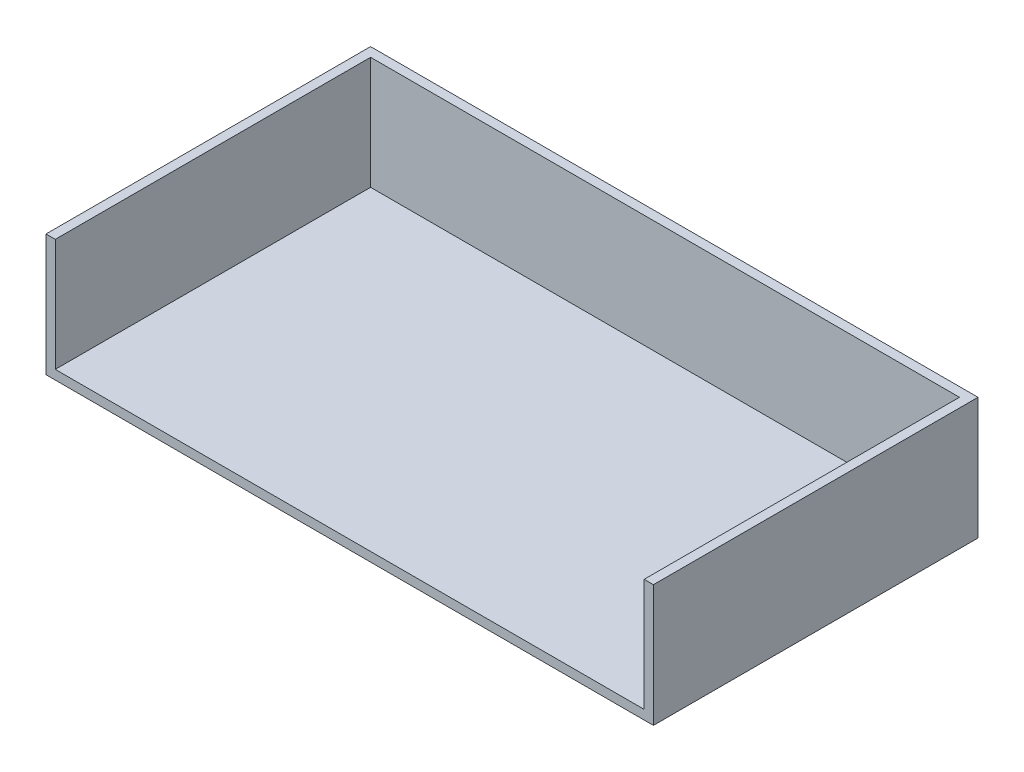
from build123d import *

# Parameters (mm, degrees)
SKETCH1_W           = 131
SKETCH1_H           = 26.29
BOSS_EXTRUDE1_DEPTH = 70
SKETCH2_W           = 127
SKETCH2_H           = 68
CUT_EXTRUDE1_DEPTH  = 24.29


with BuildPart() as part:
    # Sketch1 → Boss-Extrude1 (new body)
    with BuildSketch(Plane.XY):
        with Locations((65.5, 13.145)):
            Rectangle(SKETCH1_W, SKETCH1_H)
    extrude(amount=BOSS_EXTRUDE1_DEPTH)

    # Sketch2 → Cut-Extrude1 (cut)
    with BuildSketch(Plane(origin=(0, 26.29, 0), x_dir=(1, 0, 0), z_dir=(0, 1, 0))):
        with Locations((65.5, -36)):
            Rectangle(SKETCH2_W, SKETCH2_H)
    extrude(amount=-CUT_EXTRUDE1_DEPTH, mode=Mode.SUBTRACT)


solid = part.part
